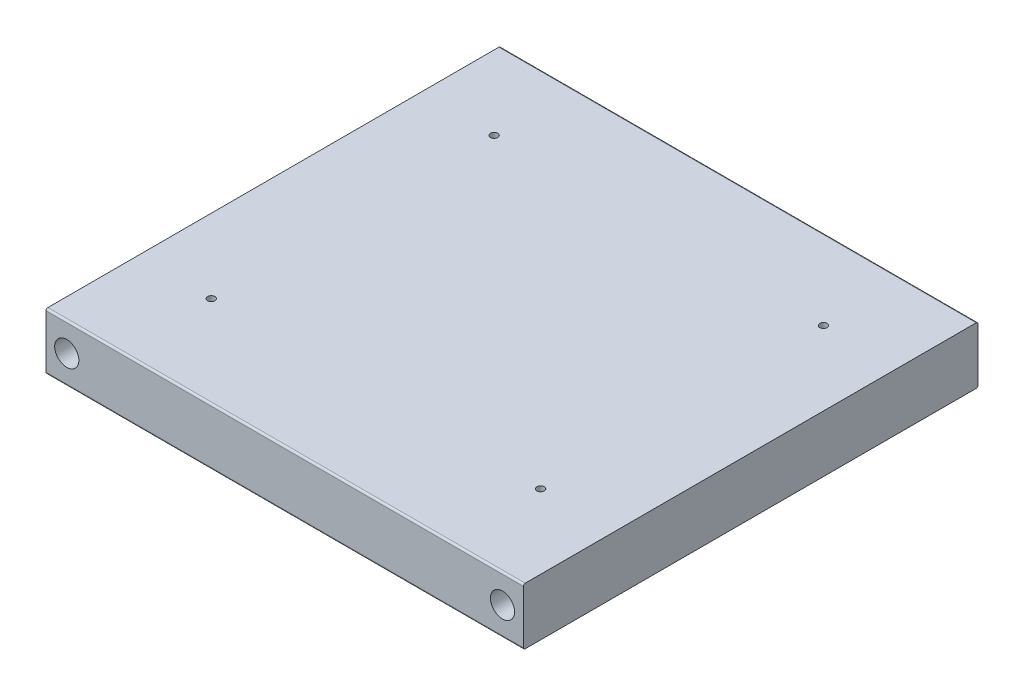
ISO-10303-21;
HEADER;
FILE_DESCRIPTION(('STEP AP214'),'2;1');
FILE_NAME('part.step','',(''),(''),'','','');
FILE_SCHEMA(('AUTOMOTIVE_DESIGN { 1 0 10303 214 1 1 1 1 }'));
ENDSEC;
DATA;
#1=APPLICATION_CONTEXT('core data for automotive mechanical design processes');
#2=APPLICATION_PROTOCOL_DEFINITION('international standard','automotive_design',2000,#1);
#3=PRODUCT_CONTEXT('',#1,'mechanical');
#4=PRODUCT('Part','Part','',(#3));
#5=PRODUCT_RELATED_PRODUCT_CATEGORY('part','',(#4));
#6=PRODUCT_DEFINITION_FORMATION('','',#4);
#7=PRODUCT_DEFINITION_CONTEXT('part definition',#1,'design');
#8=PRODUCT_DEFINITION('design','',#6,#7);
#9=PRODUCT_DEFINITION_SHAPE('','',#8);
#10=(LENGTH_UNIT() NAMED_UNIT(*) SI_UNIT(.MILLI.,.METRE.));
#11=(NAMED_UNIT(*) PLANE_ANGLE_UNIT() SI_UNIT($,.RADIAN.));
#12=(NAMED_UNIT(*) SI_UNIT($,.STERADIAN.) SOLID_ANGLE_UNIT());
#13=UNCERTAINTY_MEASURE_WITH_UNIT(LENGTH_MEASURE(1.E-05),#10,'distance_accuracy_value','');
#14=(GEOMETRIC_REPRESENTATION_CONTEXT(3) GLOBAL_UNCERTAINTY_ASSIGNED_CONTEXT((#13)) GLOBAL_UNIT_ASSIGNED_CONTEXT((#10,
#11,#12)) REPRESENTATION_CONTEXT('',''));
#15=CARTESIAN_POINT('',(0.,0.,0.));
#16=DIRECTION('',(0.,0.,1.));
#17=DIRECTION('',(1.,0.,0.));
#18=AXIS2_PLACEMENT_3D('',#15,#16,#17);
#19=CARTESIAN_POINT('',(0.,-7.9375,0.));
#20=DIRECTION('',(0.,1.,0.));
#21=DIRECTION('',(0.,0.,1.));
#22=AXIS2_PLACEMENT_3D('',#19,#20,#21);
#23=PLANE('',#22);
#24=DIRECTION('',(0.,0.,1.));
#25=VECTOR('',#24,1.);
#26=CARTESIAN_POINT('',(-66.675,-7.9375,-63.5));
#27=LINE('',#26,#25);
#28=CARTESIAN_POINT('',(-66.675,-7.9375,-62.976125));
#29=VERTEX_POINT('',#28);
#30=CARTESIAN_POINT('',(-66.675,-7.9375,62.976125));
#31=VERTEX_POINT('',#30);
#32=EDGE_CURVE('E173',#29,#31,#27,.T.);
#33=ORIENTED_EDGE('',*,*,#32,.F.);
#34=DIRECTION('',(-1.,0.,0.));
#35=VECTOR('',#34,1.);
#36=CARTESIAN_POINT('',(0.,-7.9375,-62.976125));
#37=LINE('',#36,#35);
#38=CARTESIAN_POINT('',(66.675,-7.9375,-62.976125));
#39=VERTEX_POINT('',#38);
#40=EDGE_CURVE('E162',#29,#39,#37,.F.);
#41=ORIENTED_EDGE('',*,*,#40,.T.);
#42=DIRECTION('',(0.,0.,-1.));
#43=VECTOR('',#42,1.);
#44=CARTESIAN_POINT('',(66.675,-7.9375,-63.5));
#45=LINE('',#44,#43);
#46=CARTESIAN_POINT('',(66.675,-7.9375,62.976125));
#47=VERTEX_POINT('',#46);
#48=EDGE_CURVE('E168',#47,#39,#45,.T.);
#49=ORIENTED_EDGE('',*,*,#48,.F.);
#50=DIRECTION('',(1.,0.,0.));
#51=VECTOR('',#50,1.);
#52=CARTESIAN_POINT('',(0.,-7.9375,62.976125));
#53=LINE('',#52,#51);
#54=EDGE_CURVE('E160',#47,#31,#53,.F.);
#55=ORIENTED_EDGE('',*,*,#54,.T.);
#56=EDGE_LOOP('',(#33,#41,#49,#55));
#57=FACE_BOUND('',#56,.T.);
#58=CARTESIAN_POINT('',(46.0000000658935,-7.9375,38.0000000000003));
#59=DIRECTION('',(0.,-1.,0.));
#60=DIRECTION('',(0.,0.,-1.));
#61=AXIS2_PLACEMENT_3D('',#58,#59,#60);
#62=CIRCLE('',#61,1.025);
#63=CARTESIAN_POINT('',(46.0000000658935,-7.9375,36.9750000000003));
#64=VERTEX_POINT('',#63);
#65=EDGE_CURVE('E178',#64,#64,#62,.T.);
#66=ORIENTED_EDGE('',*,*,#65,.F.);
#67=EDGE_LOOP('',(#66));
#68=FACE_BOUND('',#67,.T.);
#69=CARTESIAN_POINT('',(-45.9999999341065,-7.9375,38.));
#70=DIRECTION('',(0.,-1.,0.));
#71=DIRECTION('',(0.,0.,-1.));
#72=AXIS2_PLACEMENT_3D('',#69,#70,#71);
#73=CIRCLE('',#72,1.025);
#74=CARTESIAN_POINT('',(-45.9999999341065,-7.9375,36.975));
#75=VERTEX_POINT('',#74);
#76=EDGE_CURVE('E184',#75,#75,#73,.T.);
#77=ORIENTED_EDGE('',*,*,#76,.F.);
#78=EDGE_LOOP('',(#77));
#79=FACE_BOUND('',#78,.T.);
#80=CARTESIAN_POINT('',(-45.9999999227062,-7.9375,-41.));
#81=DIRECTION('',(0.,-1.,0.));
#82=DIRECTION('',(0.,0.,-1.));
#83=AXIS2_PLACEMENT_3D('',#80,#81,#82);
#84=CIRCLE('',#83,1.025);
#85=CARTESIAN_POINT('',(-45.9999999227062,-7.9375,-42.025));
#86=VERTEX_POINT('',#85);
#87=EDGE_CURVE('E190',#86,#86,#84,.T.);
#88=ORIENTED_EDGE('',*,*,#87,.F.);
#89=EDGE_LOOP('',(#88));
#90=FACE_BOUND('',#89,.T.);
#91=CARTESIAN_POINT('',(46.0000000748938,-7.9375,-40.9999999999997));
#92=DIRECTION('',(0.,-1.,0.));
#93=DIRECTION('',(0.,0.,-1.));
#94=AXIS2_PLACEMENT_3D('',#91,#92,#93);
#95=CIRCLE('',#94,1.025);
#96=CARTESIAN_POINT('',(46.0000000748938,-7.9375,-42.0249999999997));
#97=VERTEX_POINT('',#96);
#98=EDGE_CURVE('E196',#97,#97,#95,.T.);
#99=ORIENTED_EDGE('',*,*,#98,.F.);
#100=EDGE_LOOP('',(#99));
#101=FACE_BOUND('',#100,.T.);
#102=ADVANCED_FACE('F37',(#57,#68,#79,#90,#101),#23,.F.);
#103=CARTESIAN_POINT('',(-66.675,7.9375,-63.5));
#104=DIRECTION('',(1.,0.,0.));
#105=DIRECTION('',(0.,0.,-1.));
#106=AXIS2_PLACEMENT_3D('',#103,#104,#105);
#107=PLANE('',#106);
#108=DIRECTION('',(0.,-1.,0.));
#109=VECTOR('',#108,1.);
#110=CARTESIAN_POINT('',(-66.675,7.9375,-63.5));
#111=LINE('',#110,#109);
#112=CARTESIAN_POINT('',(-66.675,7.413625,-63.5));
#113=VERTEX_POINT('',#112);
#114=CARTESIAN_POINT('',(-66.675,-7.413625,-63.5));
#115=VERTEX_POINT('',#114);
#116=EDGE_CURVE('E112',#113,#115,#111,.T.);
#117=ORIENTED_EDGE('',*,*,#116,.T.);
#118=CARTESIAN_POINT('',(-66.675,-7.413625,-62.976125));
#119=DIRECTION('',(1.,0.,0.));
#120=DIRECTION('',(0.,0.,-1.));
#121=AXIS2_PLACEMENT_3D('',#118,#119,#120);
#122=CIRCLE('',#121,0.523875);
#123=EDGE_CURVE('E158',#115,#29,#122,.F.);
#124=ORIENTED_EDGE('',*,*,#123,.T.);
#125=ORIENTED_EDGE('',*,*,#32,.T.);
#126=CARTESIAN_POINT('',(-66.675,-7.413625,62.976125));
#127=DIRECTION('',(1.,0.,0.));
#128=DIRECTION('',(0.,0.,-1.));
#129=AXIS2_PLACEMENT_3D('',#126,#127,#128);
#130=CIRCLE('',#129,0.523875);
#131=CARTESIAN_POINT('',(-66.675,-7.413625,63.5));
#132=VERTEX_POINT('',#131);
#133=EDGE_CURVE('E150',#31,#132,#130,.F.);
#134=ORIENTED_EDGE('',*,*,#133,.T.);
#135=DIRECTION('',(0.,-1.,0.));
#136=VECTOR('',#135,1.);
#137=CARTESIAN_POINT('',(-66.675,7.9375,63.5));
#138=LINE('',#137,#136);
#139=CARTESIAN_POINT('',(-66.675,7.413625,63.5));
#140=VERTEX_POINT('',#139);
#141=EDGE_CURVE('E115',#140,#132,#138,.T.);
#142=ORIENTED_EDGE('',*,*,#141,.F.);
#143=CARTESIAN_POINT('',(-66.675,7.413625,62.976125));
#144=DIRECTION('',(1.,0.,0.));
#145=DIRECTION('',(0.,0.,-1.));
#146=AXIS2_PLACEMENT_3D('',#143,#144,#145);
#147=CIRCLE('',#146,0.523875);
#148=CARTESIAN_POINT('',(-66.675,7.9375,62.976125));
#149=VERTEX_POINT('',#148);
#150=EDGE_CURVE('E146',#140,#149,#147,.F.);
#151=ORIENTED_EDGE('',*,*,#150,.T.);
#152=DIRECTION('',(0.,0.,1.));
#153=VECTOR('',#152,1.);
#154=CARTESIAN_POINT('',(-66.675,7.9375,-63.5));
#155=LINE('',#154,#153);
#156=CARTESIAN_POINT('',(-66.675,7.9375,-62.976125));
#157=VERTEX_POINT('',#156);
#158=EDGE_CURVE('E165',#157,#149,#155,.T.);
#159=ORIENTED_EDGE('',*,*,#158,.F.);
#160=CARTESIAN_POINT('',(-66.675,7.413625,-62.976125));
#161=DIRECTION('',(1.,0.,0.));
#162=DIRECTION('',(0.,0.,-1.));
#163=AXIS2_PLACEMENT_3D('',#160,#161,#162);
#164=CIRCLE('',#163,0.523875);
#165=EDGE_CURVE('E153',#157,#113,#164,.F.);
#166=ORIENTED_EDGE('',*,*,#165,.T.);
#167=EDGE_LOOP('',(#117,#124,#125,#134,#142,#151,#159,#166));
#168=FACE_BOUND('',#167,.T.);
#169=ADVANCED_FACE('F144',(#168),#107,.F.);
#170=CARTESIAN_POINT('',(-66.675,7.9375,63.5));
#171=DIRECTION('',(0.,0.,-1.));
#172=DIRECTION('',(-1.,0.,0.));
#173=AXIS2_PLACEMENT_3D('',#170,#171,#172);
#174=PLANE('',#173);
#175=CARTESIAN_POINT('',(-60.8769503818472,0.00390912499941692,63.5));
#176=DIRECTION('',(0.,0.,1.));
#177=DIRECTION('',(1.,0.,0.));
#178=AXIS2_PLACEMENT_3D('',#175,#176,#177);
#179=CIRCLE('',#178,3.3782);
#180=CARTESIAN_POINT('',(-57.4987503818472,0.00390912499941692,63.5));
#181=VERTEX_POINT('',#180);
#182=EDGE_CURVE('E203',#181,#181,#179,.T.);
#183=ORIENTED_EDGE('',*,*,#182,.F.);
#184=EDGE_LOOP('',(#183));
#185=FACE_BOUND('',#184,.T.);
#186=CARTESIAN_POINT('',(60.8375000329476,0.00195456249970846,63.5));
#187=DIRECTION('',(0.,0.,1.));
#188=DIRECTION('',(1.,0.,0.));
#189=AXIS2_PLACEMENT_3D('',#186,#187,#188);
#190=CIRCLE('',#189,3.3782);
#191=CARTESIAN_POINT('',(64.2157000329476,0.00195456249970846,63.5));
#192=VERTEX_POINT('',#191);
#193=EDGE_CURVE('E204',#192,#192,#190,.T.);
#194=ORIENTED_EDGE('',*,*,#193,.F.);
#195=EDGE_LOOP('',(#194));
#196=FACE_BOUND('',#195,.T.);
#197=ORIENTED_EDGE('',*,*,#141,.T.);
#198=DIRECTION('',(1.,0.,0.));
#199=VECTOR('',#198,1.);
#200=CARTESIAN_POINT('',(-66.675,-7.413625,63.5));
#201=LINE('',#200,#199);
#202=CARTESIAN_POINT('',(66.675,-7.413625,63.5));
#203=VERTEX_POINT('',#202);
#204=EDGE_CURVE('E11',#132,#203,#201,.T.);
#205=ORIENTED_EDGE('',*,*,#204,.T.);
#206=DIRECTION('',(0.,-1.,0.));
#207=VECTOR('',#206,1.);
#208=CARTESIAN_POINT('',(66.675,7.9375,63.5));
#209=LINE('',#208,#207);
#210=CARTESIAN_POINT('',(66.675,7.413625,63.5));
#211=VERTEX_POINT('',#210);
#212=EDGE_CURVE('E121',#211,#203,#209,.T.);
#213=ORIENTED_EDGE('',*,*,#212,.F.);
#214=DIRECTION('',(1.,0.,0.));
#215=VECTOR('',#214,1.);
#216=CARTESIAN_POINT('',(-66.675,7.413625,63.5));
#217=LINE('',#216,#215);
#218=EDGE_CURVE('E45',#211,#140,#217,.F.);
#219=ORIENTED_EDGE('',*,*,#218,.T.);
#220=EDGE_LOOP('',(#197,#205,#213,#219));
#221=FACE_BOUND('',#220,.T.);
#222=ADVANCED_FACE('F139',(#185,#196,#221),#174,.F.);
#223=CARTESIAN_POINT('',(66.675,7.9375,-63.5));
#224=DIRECTION('',(-1.,0.,0.));
#225=DIRECTION('',(0.,0.,1.));
#226=AXIS2_PLACEMENT_3D('',#223,#224,#225);
#227=PLANE('',#226);
#228=ORIENTED_EDGE('',*,*,#48,.T.);
#229=CARTESIAN_POINT('',(66.675,-7.413625,-62.976125));
#230=DIRECTION('',(-1.,0.,0.));
#231=DIRECTION('',(0.,0.,1.));
#232=AXIS2_PLACEMENT_3D('',#229,#230,#231);
#233=CIRCLE('',#232,0.523875);
#234=CARTESIAN_POINT('',(66.675,-7.413625,-63.5));
#235=VERTEX_POINT('',#234);
#236=EDGE_CURVE('E120',#39,#235,#233,.F.);
#237=ORIENTED_EDGE('',*,*,#236,.T.);
#238=DIRECTION('',(0.,-1.,0.));
#239=VECTOR('',#238,1.);
#240=CARTESIAN_POINT('',(66.675,7.9375,-63.5));
#241=LINE('',#240,#239);
#242=CARTESIAN_POINT('',(66.675,7.413625,-63.5));
#243=VERTEX_POINT('',#242);
#244=EDGE_CURVE('E109',#243,#235,#241,.T.);
#245=ORIENTED_EDGE('',*,*,#244,.F.);
#246=CARTESIAN_POINT('',(66.675,7.413625,-62.976125));
#247=DIRECTION('',(-1.,0.,0.));
#248=DIRECTION('',(0.,0.,1.));
#249=AXIS2_PLACEMENT_3D('',#246,#247,#248);
#250=CIRCLE('',#249,0.523875);
#251=CARTESIAN_POINT('',(66.675,7.9375,-62.976125));
#252=VERTEX_POINT('',#251);
#253=EDGE_CURVE('E52',#243,#252,#250,.F.);
#254=ORIENTED_EDGE('',*,*,#253,.T.);
#255=DIRECTION('',(0.,0.,-1.));
#256=VECTOR('',#255,1.);
#257=CARTESIAN_POINT('',(66.675,7.9375,-63.5));
#258=LINE('',#257,#256);
#259=CARTESIAN_POINT('',(66.675,7.9375,62.976125));
#260=VERTEX_POINT('',#259);
#261=EDGE_CURVE('E163',#260,#252,#258,.T.);
#262=ORIENTED_EDGE('',*,*,#261,.F.);
#263=CARTESIAN_POINT('',(66.675,7.413625,62.976125));
#264=DIRECTION('',(-1.,0.,0.));
#265=DIRECTION('',(0.,0.,1.));
#266=AXIS2_PLACEMENT_3D('',#263,#264,#265);
#267=CIRCLE('',#266,0.523875);
#268=EDGE_CURVE('E60',#260,#211,#267,.F.);
#269=ORIENTED_EDGE('',*,*,#268,.T.);
#270=ORIENTED_EDGE('',*,*,#212,.T.);
#271=CARTESIAN_POINT('',(66.675,-7.413625,62.976125));
#272=DIRECTION('',(-1.,0.,0.));
#273=DIRECTION('',(0.,0.,1.));
#274=AXIS2_PLACEMENT_3D('',#271,#272,#273);
#275=CIRCLE('',#274,0.523875);
#276=EDGE_CURVE('E127',#203,#47,#275,.F.);
#277=ORIENTED_EDGE('',*,*,#276,.T.);
#278=EDGE_LOOP('',(#228,#237,#245,#254,#262,#269,#270,#277));
#279=FACE_BOUND('',#278,.T.);
#280=ADVANCED_FACE('F118',(#279),#227,.F.);
#281=CARTESIAN_POINT('',(-66.675,7.9375,-63.5));
#282=DIRECTION('',(0.,0.,1.));
#283=DIRECTION('',(1.,0.,0.));
#284=AXIS2_PLACEMENT_3D('',#281,#282,#283);
#285=PLANE('',#284);
#286=CARTESIAN_POINT('',(-60.8769503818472,0.00390912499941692,-63.5));
#287=DIRECTION('',(0.,0.,1.));
#288=DIRECTION('',(1.,0.,0.));
#289=AXIS2_PLACEMENT_3D('',#286,#287,#288);
#290=CIRCLE('',#289,3.3782);
#291=CARTESIAN_POINT('',(-57.4987503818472,0.00390912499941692,-63.5));
#292=VERTEX_POINT('',#291);
#293=EDGE_CURVE('E199',#292,#292,#290,.F.);
#294=ORIENTED_EDGE('',*,*,#293,.F.);
#295=EDGE_LOOP('',(#294));
#296=FACE_BOUND('',#295,.T.);
#297=CARTESIAN_POINT('',(60.8375000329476,0.00195456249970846,-63.5));
#298=DIRECTION('',(0.,0.,1.));
#299=DIRECTION('',(1.,0.,0.));
#300=AXIS2_PLACEMENT_3D('',#297,#298,#299);
#301=CIRCLE('',#300,3.3782);
#302=CARTESIAN_POINT('',(64.2157000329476,0.00195456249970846,-63.5));
#303=VERTEX_POINT('',#302);
#304=EDGE_CURVE('E200',#303,#303,#301,.F.);
#305=ORIENTED_EDGE('',*,*,#304,.F.);
#306=EDGE_LOOP('',(#305));
#307=FACE_BOUND('',#306,.T.);
#308=ORIENTED_EDGE('',*,*,#244,.T.);
#309=DIRECTION('',(-1.,0.,0.));
#310=VECTOR('',#309,1.);
#311=CARTESIAN_POINT('',(-66.675,-7.413625,-63.5));
#312=LINE('',#311,#310);
#313=EDGE_CURVE('E114',#235,#115,#312,.T.);
#314=ORIENTED_EDGE('',*,*,#313,.T.);
#315=ORIENTED_EDGE('',*,*,#116,.F.);
#316=DIRECTION('',(-1.,0.,0.));
#317=VECTOR('',#316,1.);
#318=CARTESIAN_POINT('',(66.675,7.413625,-63.5));
#319=LINE('',#318,#317);
#320=EDGE_CURVE('E106',#113,#243,#319,.F.);
#321=ORIENTED_EDGE('',*,*,#320,.T.);
#322=EDGE_LOOP('',(#308,#314,#315,#321));
#323=FACE_BOUND('',#322,.T.);
#324=ADVANCED_FACE('F107',(#296,#307,#323),#285,.F.);
#325=CARTESIAN_POINT('',(0.,7.9375,0.));
#326=DIRECTION('',(0.,1.,0.));
#327=DIRECTION('',(0.,0.,1.));
#328=AXIS2_PLACEMENT_3D('',#325,#326,#327);
#329=PLANE('',#328);
#330=CARTESIAN_POINT('',(46.0000000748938,7.9375,-40.9999999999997));
#331=DIRECTION('',(0.,1.,0.));
#332=DIRECTION('',(0.,0.,1.));
#333=AXIS2_PLACEMENT_3D('',#330,#331,#332);
#334=CIRCLE('',#333,1.025);
#335=CARTESIAN_POINT('',(46.0000000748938,7.9375,-39.9749999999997));
#336=VERTEX_POINT('',#335);
#337=EDGE_CURVE('E193',#336,#336,#334,.T.);
#338=ORIENTED_EDGE('',*,*,#337,.F.);
#339=EDGE_LOOP('',(#338));
#340=FACE_BOUND('',#339,.T.);
#341=CARTESIAN_POINT('',(-45.9999999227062,7.9375,-41.));
#342=DIRECTION('',(0.,1.,0.));
#343=DIRECTION('',(0.,0.,1.));
#344=AXIS2_PLACEMENT_3D('',#341,#342,#343);
#345=CIRCLE('',#344,1.025);
#346=CARTESIAN_POINT('',(-45.9999999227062,7.9375,-39.975));
#347=VERTEX_POINT('',#346);
#348=EDGE_CURVE('E187',#347,#347,#345,.T.);
#349=ORIENTED_EDGE('',*,*,#348,.F.);
#350=EDGE_LOOP('',(#349));
#351=FACE_BOUND('',#350,.T.);
#352=CARTESIAN_POINT('',(-45.9999999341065,7.9375,38.));
#353=DIRECTION('',(0.,1.,0.));
#354=DIRECTION('',(0.,0.,1.));
#355=AXIS2_PLACEMENT_3D('',#352,#353,#354);
#356=CIRCLE('',#355,1.025);
#357=CARTESIAN_POINT('',(-45.9999999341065,7.9375,39.025));
#358=VERTEX_POINT('',#357);
#359=EDGE_CURVE('E181',#358,#358,#356,.T.);
#360=ORIENTED_EDGE('',*,*,#359,.F.);
#361=EDGE_LOOP('',(#360));
#362=FACE_BOUND('',#361,.T.);
#363=CARTESIAN_POINT('',(46.0000000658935,7.9375,38.0000000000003));
#364=DIRECTION('',(0.,1.,0.));
#365=DIRECTION('',(0.,0.,1.));
#366=AXIS2_PLACEMENT_3D('',#363,#364,#365);
#367=CIRCLE('',#366,1.025);
#368=CARTESIAN_POINT('',(46.0000000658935,7.9375,39.0250000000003));
#369=VERTEX_POINT('',#368);
#370=EDGE_CURVE('E175',#369,#369,#367,.T.);
#371=ORIENTED_EDGE('',*,*,#370,.F.);
#372=EDGE_LOOP('',(#371));
#373=FACE_BOUND('',#372,.T.);
#374=ORIENTED_EDGE('',*,*,#261,.T.);
#375=DIRECTION('',(-1.,0.,0.));
#376=VECTOR('',#375,1.);
#377=CARTESIAN_POINT('',(-66.675,7.9375,-62.976125));
#378=LINE('',#377,#376);
#379=EDGE_CURVE('E126',#252,#157,#378,.T.);
#380=ORIENTED_EDGE('',*,*,#379,.T.);
#381=ORIENTED_EDGE('',*,*,#158,.T.);
#382=DIRECTION('',(1.,0.,0.));
#383=VECTOR('',#382,1.);
#384=CARTESIAN_POINT('',(66.675,7.9375,62.976125));
#385=LINE('',#384,#383);
#386=EDGE_CURVE('E129',#149,#260,#385,.T.);
#387=ORIENTED_EDGE('',*,*,#386,.T.);
#388=EDGE_LOOP('',(#374,#380,#381,#387));
#389=FACE_BOUND('',#388,.T.);
#390=ADVANCED_FACE('F228',(#340,#351,#362,#373,#389),#329,.T.);
#391=CARTESIAN_POINT('',(-66.675,-7.413625,-62.976125));
#392=DIRECTION('',(-1.,0.,0.));
#393=DIRECTION('',(0.,0.,1.));
#394=AXIS2_PLACEMENT_3D('',#391,#392,#393);
#395=CYLINDRICAL_SURFACE('',#394,0.523875);
#396=ORIENTED_EDGE('',*,*,#236,.F.);
#397=ORIENTED_EDGE('',*,*,#40,.F.);
#398=ORIENTED_EDGE('',*,*,#123,.F.);
#399=ORIENTED_EDGE('',*,*,#313,.F.);
#400=EDGE_LOOP('',(#396,#397,#398,#399));
#401=FACE_BOUND('',#400,.T.);
#402=ADVANCED_FACE('F235',(#401),#395,.T.);
#403=CARTESIAN_POINT('',(0.,7.413625,-62.976125));
#404=DIRECTION('',(1.,0.,0.));
#405=DIRECTION('',(0.,0.,-1.));
#406=AXIS2_PLACEMENT_3D('',#403,#404,#405);
#407=CYLINDRICAL_SURFACE('',#406,0.523875);
#408=ORIENTED_EDGE('',*,*,#253,.F.);
#409=ORIENTED_EDGE('',*,*,#320,.F.);
#410=ORIENTED_EDGE('',*,*,#165,.F.);
#411=ORIENTED_EDGE('',*,*,#379,.F.);
#412=EDGE_LOOP('',(#408,#409,#410,#411));
#413=FACE_BOUND('',#412,.T.);
#414=ADVANCED_FACE('F124',(#413),#407,.T.);
#415=CARTESIAN_POINT('',(-66.675,-7.413625,62.976125));
#416=DIRECTION('',(1.,0.,0.));
#417=DIRECTION('',(0.,0.,-1.));
#418=AXIS2_PLACEMENT_3D('',#415,#416,#417);
#419=CYLINDRICAL_SURFACE('',#418,0.523875);
#420=ORIENTED_EDGE('',*,*,#133,.F.);
#421=ORIENTED_EDGE('',*,*,#54,.F.);
#422=ORIENTED_EDGE('',*,*,#276,.F.);
#423=ORIENTED_EDGE('',*,*,#204,.F.);
#424=EDGE_LOOP('',(#420,#421,#422,#423));
#425=FACE_BOUND('',#424,.T.);
#426=ADVANCED_FACE('F294',(#425),#419,.T.);
#427=CARTESIAN_POINT('',(0.,7.413625,62.976125));
#428=DIRECTION('',(-1.,0.,0.));
#429=DIRECTION('',(0.,0.,1.));
#430=AXIS2_PLACEMENT_3D('',#427,#428,#429);
#431=CYLINDRICAL_SURFACE('',#430,0.523875);
#432=ORIENTED_EDGE('',*,*,#150,.F.);
#433=ORIENTED_EDGE('',*,*,#218,.F.);
#434=ORIENTED_EDGE('',*,*,#268,.F.);
#435=ORIENTED_EDGE('',*,*,#386,.F.);
#436=EDGE_LOOP('',(#432,#433,#434,#435));
#437=FACE_BOUND('',#436,.T.);
#438=ADVANCED_FACE('F39',(#437),#431,.T.);
#439=CARTESIAN_POINT('',(46.0000000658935,-7.9375,38.0000000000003));
#440=DIRECTION('',(0.,-1.,0.));
#441=DIRECTION('',(0.,0.,-1.));
#442=AXIS2_PLACEMENT_3D('',#439,#440,#441);
#443=CYLINDRICAL_SURFACE('',#442,1.025);
#444=ORIENTED_EDGE('',*,*,#65,.T.);
#445=EDGE_LOOP('',(#444));
#446=FACE_BOUND('',#445,.T.);
#447=ORIENTED_EDGE('',*,*,#370,.T.);
#448=EDGE_LOOP('',(#447));
#449=FACE_BOUND('',#448,.T.);
#450=ADVANCED_FACE('F250',(#446,#449),#443,.F.);
#451=CARTESIAN_POINT('',(-45.9999999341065,-7.9375,38.));
#452=DIRECTION('',(0.,-1.,0.));
#453=DIRECTION('',(0.,0.,-1.));
#454=AXIS2_PLACEMENT_3D('',#451,#452,#453);
#455=CYLINDRICAL_SURFACE('',#454,1.025);
#456=ORIENTED_EDGE('',*,*,#76,.T.);
#457=EDGE_LOOP('',(#456));
#458=FACE_BOUND('',#457,.T.);
#459=ORIENTED_EDGE('',*,*,#359,.T.);
#460=EDGE_LOOP('',(#459));
#461=FACE_BOUND('',#460,.T.);
#462=ADVANCED_FACE('F253',(#458,#461),#455,.F.);
#463=CARTESIAN_POINT('',(-45.9999999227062,-7.9375,-41.));
#464=DIRECTION('',(0.,-1.,0.));
#465=DIRECTION('',(0.,0.,-1.));
#466=AXIS2_PLACEMENT_3D('',#463,#464,#465);
#467=CYLINDRICAL_SURFACE('',#466,1.025);
#468=ORIENTED_EDGE('',*,*,#87,.T.);
#469=EDGE_LOOP('',(#468));
#470=FACE_BOUND('',#469,.T.);
#471=ORIENTED_EDGE('',*,*,#348,.T.);
#472=EDGE_LOOP('',(#471));
#473=FACE_BOUND('',#472,.T.);
#474=ADVANCED_FACE('F257',(#470,#473),#467,.F.);
#475=CARTESIAN_POINT('',(46.0000000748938,-7.9375,-40.9999999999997));
#476=DIRECTION('',(0.,-1.,0.));
#477=DIRECTION('',(0.,0.,-1.));
#478=AXIS2_PLACEMENT_3D('',#475,#476,#477);
#479=CYLINDRICAL_SURFACE('',#478,1.025);
#480=ORIENTED_EDGE('',*,*,#98,.T.);
#481=EDGE_LOOP('',(#480));
#482=FACE_BOUND('',#481,.T.);
#483=ORIENTED_EDGE('',*,*,#337,.T.);
#484=EDGE_LOOP('',(#483));
#485=FACE_BOUND('',#484,.T.);
#486=ADVANCED_FACE('F223',(#482,#485),#479,.F.);
#487=CARTESIAN_POINT('',(60.8375000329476,0.00195456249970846,-63.501));
#488=DIRECTION('',(0.,0.,1.));
#489=DIRECTION('',(1.,0.,0.));
#490=AXIS2_PLACEMENT_3D('',#487,#488,#489);
#491=CYLINDRICAL_SURFACE('',#490,3.3782);
#492=ORIENTED_EDGE('',*,*,#193,.T.);
#493=EDGE_LOOP('',(#492));
#494=FACE_BOUND('',#493,.T.);
#495=ORIENTED_EDGE('',*,*,#304,.T.);
#496=EDGE_LOOP('',(#495));
#497=FACE_BOUND('',#496,.T.);
#498=ADVANCED_FACE('F220',(#494,#497),#491,.F.);
#499=CARTESIAN_POINT('',(-60.8769503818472,0.00390912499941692,-63.501));
#500=DIRECTION('',(0.,0.,1.));
#501=DIRECTION('',(1.,0.,0.));
#502=AXIS2_PLACEMENT_3D('',#499,#500,#501);
#503=CYLINDRICAL_SURFACE('',#502,3.3782);
#504=ORIENTED_EDGE('',*,*,#182,.T.);
#505=EDGE_LOOP('',(#504));
#506=FACE_BOUND('',#505,.T.);
#507=ORIENTED_EDGE('',*,*,#293,.T.);
#508=EDGE_LOOP('',(#507));
#509=FACE_BOUND('',#508,.T.);
#510=ADVANCED_FACE('F212',(#506,#509),#503,.F.);
#511=CLOSED_SHELL('',(#102,#169,#222,#280,#324,#390,#402,#414,#426,#438,#450,#462,#474,#486,
#498,#510));
#512=MANIFOLD_SOLID_BREP('B2',#511);
#513=ADVANCED_BREP_SHAPE_REPRESENTATION('',(#18,#512),#14);
#514=SHAPE_DEFINITION_REPRESENTATION(#9,#513);
ENDSEC;
END-ISO-10303-21;
